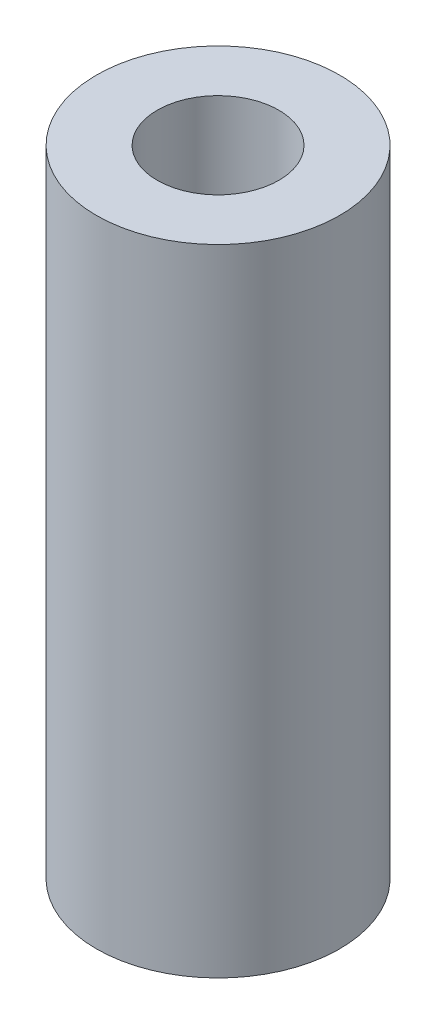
from build123d import *

# Parameters (mm, degrees)
SKETCH1_R           = 15.875
SKETCH1_R_2         = 7.9375
BOSS_EXTRUDE1_DEPTH = 41.4528


with BuildPart() as part:
    # Sketch1 → Boss-Extrude1 (new, symmetric)
    with BuildSketch(Plane(origin=(0, 0, 0), x_dir=(1, 0, 0), z_dir=(0, 1, 0))):
        with Locations(Location((0, 0, 0), (0, 0, 270))):
            Circle(SKETCH1_R)
        with Locations(Location((0, 0, 0), (0, 0, 270))):
            Circle(SKETCH1_R_2, mode=Mode.SUBTRACT)
    extrude(amount=BOSS_EXTRUDE1_DEPTH, both=True)


solid = part.part
